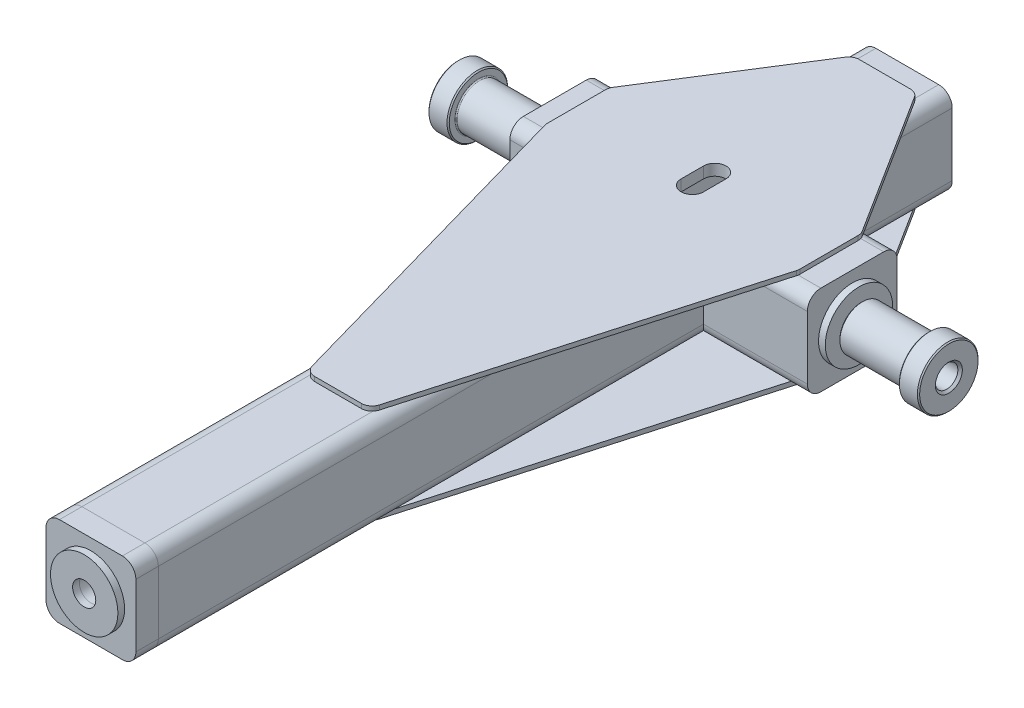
from build123d import *

# Parameters (mm, degrees)
BOSS_EXTRU_20_DEPTH           = 56.2
BOSS_EXTRU_20_DEPTH_BACK      = 56.2
ESQUISSE25_R                  = 5.15
BOSS_EXTRU_22_DEPTH           = 10
ESQUISSE26_R                  = 15
ESQUISSE26_R_2                = 5.1
BOSS_EXTRU_23_DEPTH           = 3
ENL_V_MAT_EXTRU_12_DEPTH      = 18.5
ENL_V_MAT_EXTRU_12_DEPTH_BACK = 18.5
BOSS_EXTRU_45_DEPTH           = 60.7
BOSS_EXTRU_45_DEPTH_BACK      = 282.7
ESQUISSE63_R                  = 5.15
BOSS_EXTRU_46_DEPTH           = 10
ESQUISSE64_R                  = 15
ESQUISSE64_R_2                = 5.15
BOSS_EXTRU_47_DEPTH           = 3
ESQUISSE65_R                  = 5.15
BOSS_EXTRU_48_DEPTH           = 10
ESQUISSE66_R                  = 15
ESQUISSE66_R_2                = 5.15
BOSS_EXTRU_49_DEPTH           = 3
BOSS_EXTRU_50_DEPTH           = 2
ESQUISSE136_R                 = 5.15
BOSS_EXTRU_51_DEPTH           = 10
ESQUISSE137_R                 = 15
ESQUISSE137_R_2               = 5.1
BOSS_EXTRU_52_DEPTH           = 3
BOSS_EXTRU_53_DEPTH           = 2
ENL_V_MAT_EXTRU_30_DEPTH      = 242.797601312


with BuildPart() as part:
    # Esquisse24 → Boss.-Extru.20 (new, two sides: drawn at the far end of the back side and taken through both)
    with BuildSketch(Plane(origin=(0, 0, 0), x_dir=(0, 0, -1), z_dir=(1, 0, 0)).offset(-BOSS_EXTRU_20_DEPTH_BACK)):
        with BuildLine():
            Line((103.5, 320), (131.5, 320))
            ThreePointArc((131.5, 320), (135.742640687, 318.242640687), (137.5, 314))
            Line((137.5, 314), (137.5, 286))
            ThreePointArc((137.5, 286), (135.742640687, 281.757359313), (131.5, 280))
            Line((131.5, 280), (103.5, 280))
            ThreePointArc((103.5, 280), (99.257359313, 281.757359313), (97.5, 286))
            Line((97.5, 286), (97.5, 314))
            ThreePointArc((97.5, 314), (99.257359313, 318.242640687), (103.5, 320))
        make_face()
        with BuildLine():
            Line((103.5, 317), (131.5, 317))
            ThreePointArc((131.5, 317), (133.621320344, 316.121320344), (134.5, 314))
            Line((134.5, 314), (134.5, 286))
            ThreePointArc((134.5, 286), (133.621320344, 283.878679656), (131.5, 283))
            Line((131.5, 283), (103.5, 283))
            ThreePointArc((103.5, 283), (101.378679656, 283.878679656), (100.5, 286))
            Line((100.5, 286), (100.5, 314))
            ThreePointArc((100.5, 314), (101.378679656, 316.121320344), (103.5, 317))
        make_face(mode=Mode.SUBTRACT)
    extrude(amount=BOSS_EXTRU_20_DEPTH + BOSS_EXTRU_20_DEPTH_BACK)

    # Esquisse24_2 → Enl_v. mat.-Extru.12 (cut, two sides: drawn at the far end of the back side and taken through both)
    with BuildSketch(Plane(origin=(0, 0, 0), x_dir=(0, 0, -1), z_dir=(1, 0, 0)).offset(-ENL_V_MAT_EXTRU_12_DEPTH_BACK)):
        with BuildLine():
            Line((103.5, 320), (131.5, 320))
            ThreePointArc((131.5, 320), (135.742640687, 318.242640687), (137.5, 314))
            Line((137.5, 314), (137.5, 286))
            ThreePointArc((137.5, 286), (135.742640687, 281.757359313), (131.5, 280))
            Line((131.5, 280), (103.5, 280))
            ThreePointArc((103.5, 280), (99.257359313, 281.757359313), (97.5, 286))
            Line((97.5, 286), (97.5, 314))
            ThreePointArc((97.5, 314), (99.257359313, 318.242640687), (103.5, 320))
        make_face()
        with BuildLine():
            Line((103.5, 317), (131.5, 317))
            ThreePointArc((131.5, 317), (133.621320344, 316.121320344), (134.5, 314))
            Line((134.5, 314), (134.5, 286))
            ThreePointArc((134.5, 286), (133.621320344, 283.878679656), (131.5, 283))
            Line((131.5, 283), (103.5, 283))
            ThreePointArc((103.5, 283), (101.378679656, 283.878679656), (100.5, 286))
            Line((100.5, 286), (100.5, 314))
            ThreePointArc((100.5, 314), (101.378679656, 316.121320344), (103.5, 317))
        make_face(mode=Mode.SUBTRACT)
    extrude(amount=ENL_V_MAT_EXTRU_12_DEPTH + ENL_V_MAT_EXTRU_12_DEPTH_BACK, mode=Mode.SUBTRACT)


with BuildPart() as body_2:
    # Esquisse25 → Boss.-Extru.22 (new body)
    with BuildSketch(Plane(origin=(56.2, 0, 0), x_dir=(0, 0, -1), z_dir=(1, 0, 0))):
        with BuildLine():
            Line((131.5, 320), (103.5, 320))
            ThreePointArc((103.5, 320), (99.257359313, 318.242640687), (97.5, 314))
            Line((97.5, 314), (97.5, 286))
            ThreePointArc((97.5, 286), (99.257359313, 281.757359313), (103.5, 280))
            Line((103.5, 280), (131.5, 280))
            ThreePointArc((131.5, 280), (135.742640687, 281.757359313), (137.5, 286))
            Line((137.5, 286), (137.5, 314))
            ThreePointArc((137.5, 314), (135.742640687, 318.242640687), (131.5, 320))
        make_face()
        with Locations((117.5, 300)):
            Circle(ESQUISSE25_R, mode=Mode.SUBTRACT)
    extrude(amount=BOSS_EXTRU_22_DEPTH)



with BuildPart() as body_3:
    # Esquisse26 → Boss.-Extru.23 (new body)
    with BuildSketch(Plane(origin=(66.2, 0, 0), x_dir=(0, 0, -1), z_dir=(1, 0, 0))):
        with Locations((117.5, 300)):
            Circle(ESQUISSE26_R)
        with Locations((117.5, 300)):
            Circle(ESQUISSE26_R_2, mode=Mode.SUBTRACT)
    extrude(amount=BOSS_EXTRU_23_DEPTH)


with BuildPart() as enl_v_mat_extru_12_piece_1:
    # of the separate pieces the step leaves, piece 1, a body of its own (enl_v_mat_extru_12_pieces)
    add(part.part.solids().sort_by_distance((18.5, 314, -97.5))[0])

    # Esquisse61 → Boss.-Extru.45 (add, two sides: drawn at the far end of the back side and taken through both)
    with BuildSketch(Plane(origin=(0, 0, -137.5), x_dir=(-1, 0, 0), z_dir=(0, 0, -1)).offset(-BOSS_EXTRU_45_DEPTH_BACK)):
        with BuildLine():
            Line((-14, 280), (14, 280))
            ThreePointArc((14, 280), (18.242640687, 281.757359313), (20, 286))
            Line((20, 286), (20, 314))
            ThreePointArc((20, 314), (18.242640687, 318.242640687), (14, 320))
            Line((14, 320), (-14, 320))
            ThreePointArc((-14, 320), (-18.242640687, 318.242640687), (-20, 314))
            Line((-20, 314), (-20, 286))
            ThreePointArc((-20, 286), (-18.242640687, 281.757359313), (-14, 280))
        make_face()
        with BuildLine():
            Line((-14, 283), (14, 283))
            ThreePointArc((14, 283), (16.121320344, 283.878679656), (17, 286))
            Line((17, 286), (17, 314))
            ThreePointArc((17, 314), (16.121320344, 316.121320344), (14, 317))
            Line((14, 317), (-14, 317))
            ThreePointArc((-14, 317), (-16.121320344, 316.121320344), (-17, 314))
            Line((-17, 314), (-17, 286))
            ThreePointArc((-17, 286), (-16.121320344, 283.878679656), (-14, 283))
        make_face(mode=Mode.SUBTRACT)
    extrude(amount=BOSS_EXTRU_45_DEPTH + BOSS_EXTRU_45_DEPTH_BACK)


with BuildPart() as enl_v_mat_extru_12_piece_2:
    # of the separate pieces the step leaves, piece 2, a body of its own (enl_v_mat_extru_12_pieces)
    add(part.part.solids().sort_by_distance((-56.2, 314, -97.5))[0])



with BuildPart() as body_5:
    # Esquisse63 → Boss.-Extru.46 (new body)
    with BuildSketch(Plane(origin=(0, 0, -198.2), x_dir=(-1, 0, 0), z_dir=(0, 0, -1))):
        with BuildLine():
            Line((-14, 280), (14, 280))
            ThreePointArc((14, 280), (18.242640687, 281.757359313), (20, 286))
            Line((20, 286), (20, 314))
            ThreePointArc((20, 314), (18.242640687, 318.242640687), (14, 320))
            Line((14, 320), (-14, 320))
            ThreePointArc((-14, 320), (-18.242640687, 318.242640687), (-20, 314))
            Line((-20, 314), (-20, 286))
            ThreePointArc((-20, 286), (-18.242640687, 281.757359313), (-14, 280))
        make_face()
        with Locations(Location((0, 300, 0), (0, 0, 90))):
            Circle(ESQUISSE63_R, mode=Mode.SUBTRACT)
    extrude(amount=BOSS_EXTRU_46_DEPTH)


with BuildPart() as body_6:
    # Esquisse64 → Boss.-Extru.47 (new body)
    with BuildSketch(Plane(origin=(0, 0, -208.2), x_dir=(-1, 0, 0), z_dir=(0, 0, -1))):
        with Locations(Location((0, 300, 0), (0, 0, 90))):
            Circle(ESQUISSE64_R)
        with Locations(Location((0, 300, 0), (0, 0, 90))):
            Circle(ESQUISSE64_R_2, mode=Mode.SUBTRACT)
    extrude(amount=BOSS_EXTRU_47_DEPTH)


with BuildPart() as body_7:
    # Esquisse65 → Boss.-Extru.48 (new body)
    with BuildSketch(Plane.XY.offset(145.2)):
        with BuildLine():
            Line((14, 280), (-14, 280))
            ThreePointArc((-14, 280), (-18.242640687, 281.757359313), (-20, 286))
            Line((-20, 286), (-20, 314))
            ThreePointArc((-20, 314), (-18.242640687, 318.242640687), (-14, 320))
            Line((-14, 320), (14, 320))
            ThreePointArc((14, 320), (18.242640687, 318.242640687), (20, 314))
            Line((20, 314), (20, 286))
            ThreePointArc((20, 286), (18.242640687, 281.757359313), (14, 280))
        make_face()
        with Locations((0, 300)):
            Circle(ESQUISSE65_R, mode=Mode.SUBTRACT)
    extrude(amount=BOSS_EXTRU_48_DEPTH)


with BuildPart() as body_8:
    # Esquisse66 → Boss.-Extru.49 (new body)
    with BuildSketch(Plane.XY.offset(155.2)):
        with Locations((0, 300)):
            Circle(ESQUISSE66_R)
        with Locations((0, 300)):
            Circle(ESQUISSE66_R_2, mode=Mode.SUBTRACT)
    extrude(amount=BOSS_EXTRU_49_DEPTH)


with BuildPart() as body_9:
    # Esquisse67 → Boss.-Extru.50 (new body)
    with BuildSketch(Plane(origin=(0, 320, 0), x_dir=(1, 0, 0), z_dir=(0, 1, 0))):
        with BuildLine():
            Line((56.2, 130.109064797), (56.2, 104.16791508))
            ThreePointArc((56.2, 104.16791508), (56.154194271, 103.50637382), (56.017651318, 102.857458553))
            Line((56.017651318, 102.857458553), (14.990307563, -41.710456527))
            ThreePointArc((14.990307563, -41.710456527), (13.266598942, -44.229503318), (10.372656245, -45.2))
            Line((10.372656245, -45.2), (-10.372656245, -45.2))
            ThreePointArc((-10.372656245, -45.2), (-13.266598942, -44.229503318), (-14.990307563, -41.710456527))
            Line((-14.990307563, -41.710456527), (-56.017651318, 102.857458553))
            ThreePointArc((-56.017651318, 102.857458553), (-56.154194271, 103.50637382), (-56.2, 104.16791508))
            Line((-56.2, 104.16791508), (-56.2, 130.109064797))
            ThreePointArc((-56.2, 130.109064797), (-56.010333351, 131.445038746), (-55.456322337, 132.675433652))
            Line((-55.456322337, 132.675433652), (-15.413181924, 195.966368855))
            ThreePointArc((-15.413181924, 195.966368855), (-13.672181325, 197.604674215), (-11.356859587, 198.2))
            Line((-11.356859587, 198.2), (11.356859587, 198.2))
            ThreePointArc((11.356859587, 198.2), (13.672181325, 197.604674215), (15.413181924, 195.966368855))
            Line((15.413181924, 195.966368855), (55.456322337, 132.675433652))
            ThreePointArc((55.456322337, 132.675433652), (56.010333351, 131.445038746), (56.2, 130.109064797))
        make_face()
    extrude(amount=BOSS_EXTRU_50_DEPTH)


with BuildPart() as enl_v_mat_extru_12_piece_2_1:
    add(enl_v_mat_extru_12_piece_2.part)

    add(body_9.part)  # Boss.-Extru.51 merges body 9
    # Esquisse136 → Boss.-Extru.51 (add)
    with BuildSketch(Plane.ZY.offset(56.2)):
        with BuildLine():
            Line((-131.5, 280), (-103.5, 280))
            ThreePointArc((-103.5, 280), (-99.257359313, 281.757359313), (-97.5, 286))
            Line((-97.5, 286), (-97.5, 314))
            ThreePointArc((-97.5, 314), (-99.257359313, 318.242640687), (-103.5, 320))
            Line((-103.5, 320), (-131.5, 320))
            ThreePointArc((-131.5, 320), (-135.742640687, 318.242640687), (-137.5, 314))
            Line((-137.5, 314), (-137.5, 286))
            ThreePointArc((-137.5, 286), (-135.742640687, 281.757359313), (-131.5, 280))
        make_face()
        with Locations(Location((-117.5, 300, 0), (0, 0, 180))):
            Circle(ESQUISSE136_R, mode=Mode.SUBTRACT)
    extrude(amount=BOSS_EXTRU_51_DEPTH)

    # Esquisse137 → Boss.-Extru.52 (add)
    with BuildSketch(Plane.ZY.offset(66.2)):
        with Locations(Location((-117.5, 300, 0), (0, 0, 180))):
            Circle(ESQUISSE137_R)
        with Locations(Location((-117.5, 300, 0), (0, 0, 180))):
            Circle(ESQUISSE137_R_2, mode=Mode.SUBTRACT)
    extrude(amount=BOSS_EXTRU_52_DEPTH)


with BuildPart() as body_2_1:
    add(body_2.part)

    add(enl_v_mat_extru_12_piece_1.part)  # Boss.-Extru.53 merges Enl_v. mat.-Extru.12 piece 1

    add(enl_v_mat_extru_12_piece_2_1.part)  # Boss.-Extru.53 merges Enl_v. mat.-Extru.12 piece 2

    add(body_5.part)  # Boss.-Extru.53 merges body 5
    # Esquisse138 → Boss.-Extru.53 (add)
    with BuildSketch(Plane.XZ.offset(-280)):
        with BuildLine():
            Line((56.2, -130.109064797), (56.2, -104.16791508))
            ThreePointArc((56.2, -104.16791508), (56.154194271, -103.50637382), (56.017651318, -102.857458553))
            Line((56.017651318, -102.857458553), (14.990307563, 41.710456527))
            ThreePointArc((14.990307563, 41.710456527), (13.266598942, 44.229503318), (10.372656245, 45.2))
            Line((10.372656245, 45.2), (-10.372656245, 45.2))
            ThreePointArc((-10.372656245, 45.2), (-13.266598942, 44.229503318), (-14.990307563, 41.710456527))
            Line((-14.990307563, 41.710456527), (-56.017651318, -102.857458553))
            ThreePointArc((-56.017651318, -102.857458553), (-56.154194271, -103.50637382), (-56.2, -104.16791508))
            Line((-56.2, -104.16791508), (-56.2, -130.109064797))
            ThreePointArc((-56.2, -130.109064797), (-56.010333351, -131.445038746), (-55.456322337, -132.675433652))
            Line((-55.456322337, -132.675433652), (-15.413181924, -195.966368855))
            ThreePointArc((-15.413181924, -195.966368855), (-13.672181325, -197.604674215), (-11.356859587, -198.2))
            Line((-11.356859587, -198.2), (11.356859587, -198.2))
            ThreePointArc((11.356859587, -198.2), (13.672181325, -197.604674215), (15.413181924, -195.966368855))
            Line((15.413181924, -195.966368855), (55.456322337, -132.675433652))
            ThreePointArc((55.456322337, -132.675433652), (56.010333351, -131.445038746), (56.2, -130.109064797))
        make_face()
    extrude(amount=BOSS_EXTRU_53_DEPTH)

    # Esquisse135 → Enl_v. mat.-Extru.30 (cut, through all)
    with BuildSketch(Plane(origin=(0, 322, 0), x_dir=(1, 0, 0), z_dir=(0, 1, 0))):
        with BuildLine():
            Line((5, 122.5), (5, 112.5))
            ThreePointArc((5, 112.5), (0, 107.5), (-5, 112.5))
            Line((-5, 112.5), (-5, 122.5))
            ThreePointArc((-5, 122.5), (0, 127.5), (5, 122.5))
        make_face()
    extrude(amount=-ENL_V_MAT_EXTRU_30_DEPTH, mode=Mode.SUBTRACT)


with BuildPart() as body_6_2:
    # Esquisse120 → R_volution2 (revolve)
    with BuildSketch(Plane(origin=(0, 0, -117.5), x_dir=(-1, 0, 0), z_dir=(0, 0, -1)), mode=Mode.PRIVATE) as r_volution2_sk:
        with BuildLine():
            Line((-71.2, 305), (-108.2, 305))
            Line((-108.2, 305), (-109.2, 306))
            Line((-109.2, 306), (-109.2, 313))
            Line((-109.2, 313), (-108.7, 313.5))
            Line((-108.7, 313.5), (-100.7, 313.5))
            Line((-100.7, 313.5), (-100.2, 313))
            Line((-100.2, 313), (-100.2, 310.5))
            ThreePointArc((-100.2, 310.5), (-100.053553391, 310.146446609), (-99.7, 310))
            Line((-99.7, 310), (-70.7, 310))
            Line((-70.7, 310), (-70.2, 309.5))
            Line((-70.2, 309.5), (-70.2, 306))
            Line((-70.2, 306), (-71.2, 305))
        make_face()
        with BuildLine():
            Line((108.2, 305), (109.2, 306))
            Line((109.2, 306), (109.2, 313))
            Line((109.2, 313), (108.7, 313.5))
            Line((108.7, 313.5), (100.7, 313.5))
            Line((100.7, 313.5), (100.2, 313))
            Line((100.2, 313), (100.2, 310.5))
            ThreePointArc((100.2, 310.5), (100.053553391, 310.146446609), (99.7, 310))
            Line((99.7, 310), (70.7, 310))
            Line((70.7, 310), (70.2, 309.5))
            Line((70.2, 309.5), (70.2, 306))
            Line((70.2, 306), (71.2, 305))
            Line((71.2, 305), (108.2, 305))
        make_face()
    revolve(r_volution2_sk.sketch.rotate(Axis((69.2, 300, -117.5), (1, 0, 0)), 90), axis=Axis((69.2, 300, -117.5), (1, 0, 0)))


solid = Compound([body_3.part, body_6.part, body_7.part, body_8.part, body_2_1.part, body_6_2.part])
